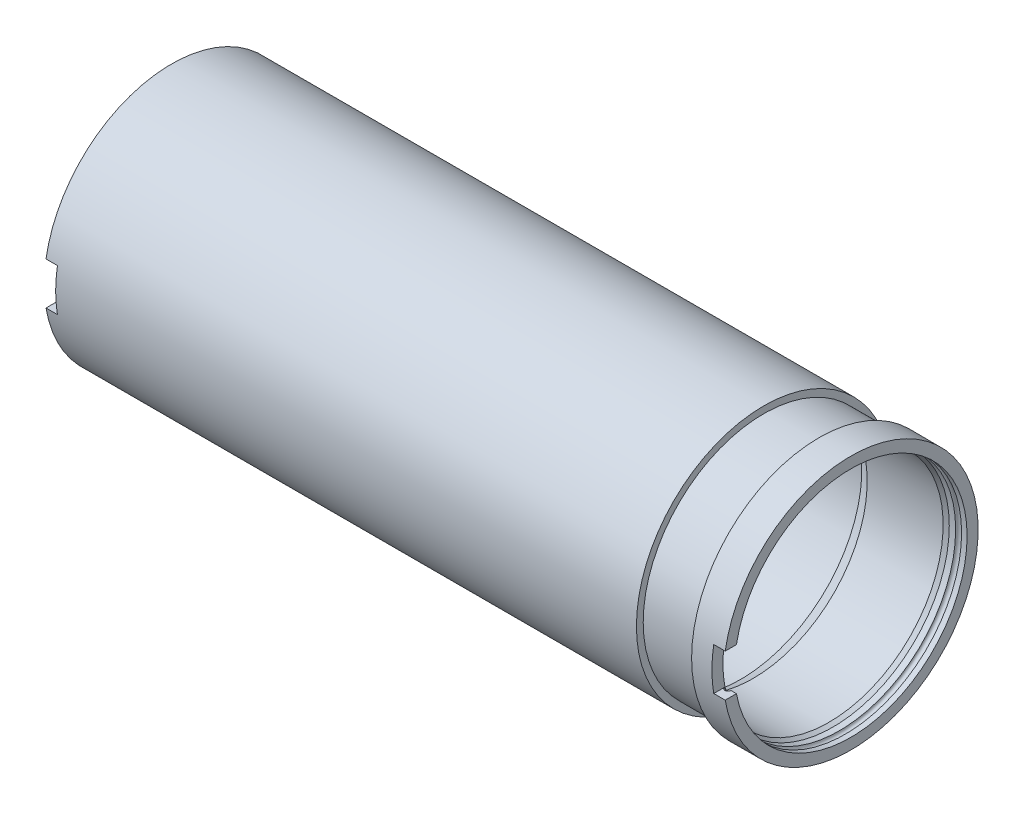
from build123d import *

# Parameters (mm, degrees)
SKETCH2_W          = 3.81
SKETCH2_H          = 5.08
SKETCH4_W          = 3.429
SKETCH4_H          = 12.7
CUT_EXTRUDE2_DEPTH = 211.222406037


with BuildPart() as part:
    # Sketch1 → Case 2 (revolve)
    with BuildSketch(Plane.XY, mode=Mode.PRIVATE) as case_2_sk:
        with BuildLine():
            Line((177.165, 38.1), (0, 38.1))
            Line((0, 38.1), (0, 34.798))
            Line((0, 34.798), (1.651, 34.798))
            ThreePointArc((1.651, 34.798), (2.54, 35.687), (3.429, 34.798))
            Line((3.429, 34.798), (5.334, 34.798))
            Line((5.334, 34.798), (6.499843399, 34.1249))
            Line((6.499843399, 34.1249), (19.05, 34.1249))
            Line((19.05, 34.1249), (22.855488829, 36.322))
            Line((22.855488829, 36.322), (170.184511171, 36.322))
            Line((170.184511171, 36.322), (173.99, 34.1249))
            Line((173.99, 34.1249), (196.700156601, 34.1249))
            Line((196.700156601, 34.1249), (197.866, 34.798))
            Line((197.866, 34.798), (199.771, 34.798))
            ThreePointArc((199.771, 34.798), (200.66, 35.687), (201.549, 34.798))
            Line((201.549, 34.798), (203.2, 34.798))
            Line((203.2, 34.798), (203.2, 38.1))
            Line((203.2, 38.1), (193.675, 38.1))
            Line((193.675, 38.1), (193.675, 36.068))
            Line((193.675, 36.068), (177.165, 36.068))
            Line((177.165, 36.068), (177.165, 38.1))
        make_face()
    revolve(case_2_sk.sketch.rotate(Axis((-166.103267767, 0, 0), (1, 0, 0)), 90), axis=Axis((-166.103267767, 0, 0), (1, 0, 0)))

    # Sketch2 → Revolve3 (revolve)
    with BuildSketch(Plane.XY, mode=Mode.PRIVATE) as revolve3_sk:
        with Locations((111.76, 33.782)):
            Rectangle(SKETCH2_W, SKETCH2_H)
    revolve(revolve3_sk.sketch.rotate(Axis((-23.580951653, 0, 0), (1, 0, 0)), 90), axis=Axis((-23.580951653, 0, 0), (1, 0, 0)))

    # Sketch4 → Cut-Extrude2 (cut, through all)
    with BuildSketch(Plane.XY):
        with Locations((1.7145, 0)):
            Rectangle(SKETCH4_W, SKETCH4_H)
        with Locations((201.4855, 0)):
            Rectangle(SKETCH4_W, SKETCH4_H)
    extrude(amount=CUT_EXTRUDE2_DEPTH, mode=Mode.SUBTRACT)


solid = part.part
